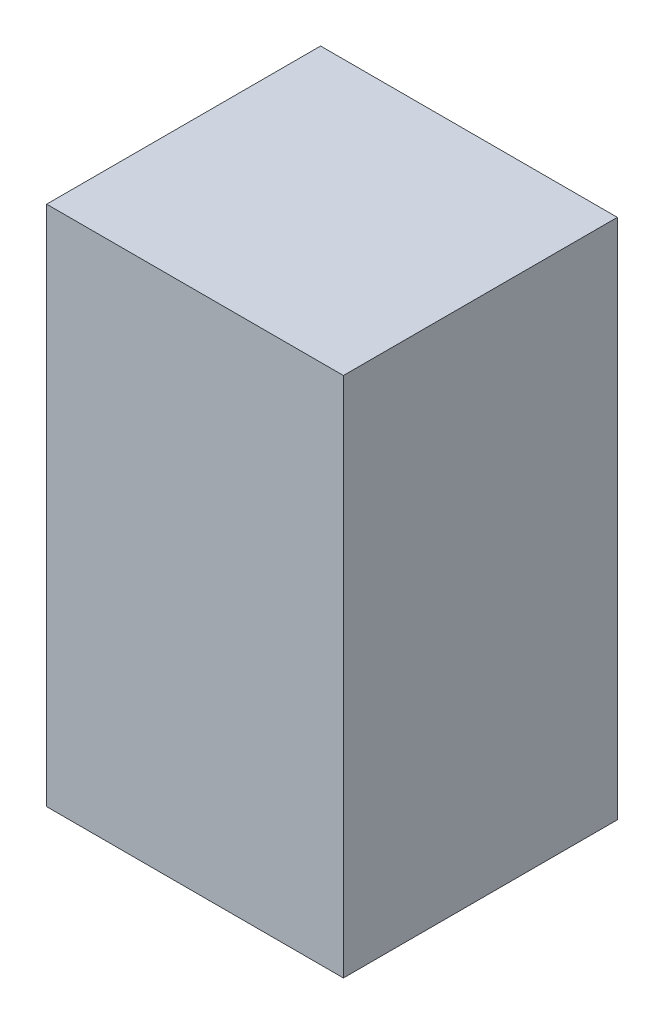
from build123d import *

# Parameters (mm, degrees)
SKETCH1_W      = 23.114
SKETCH1_H      = 21.336
EXTRUDE1_DEPTH = 40.64


with BuildPart() as part:
    # Sketch1 → Extrude1 (new body)
    with BuildSketch(Plane(origin=(0, 0, 0), x_dir=(1, 0, 0), z_dir=(0, 1, 0))):
        with Locations((2.032, 0)):
            Rectangle(SKETCH1_W, SKETCH1_H)
    extrude(amount=EXTRUDE1_DEPTH)


solid = part.part
